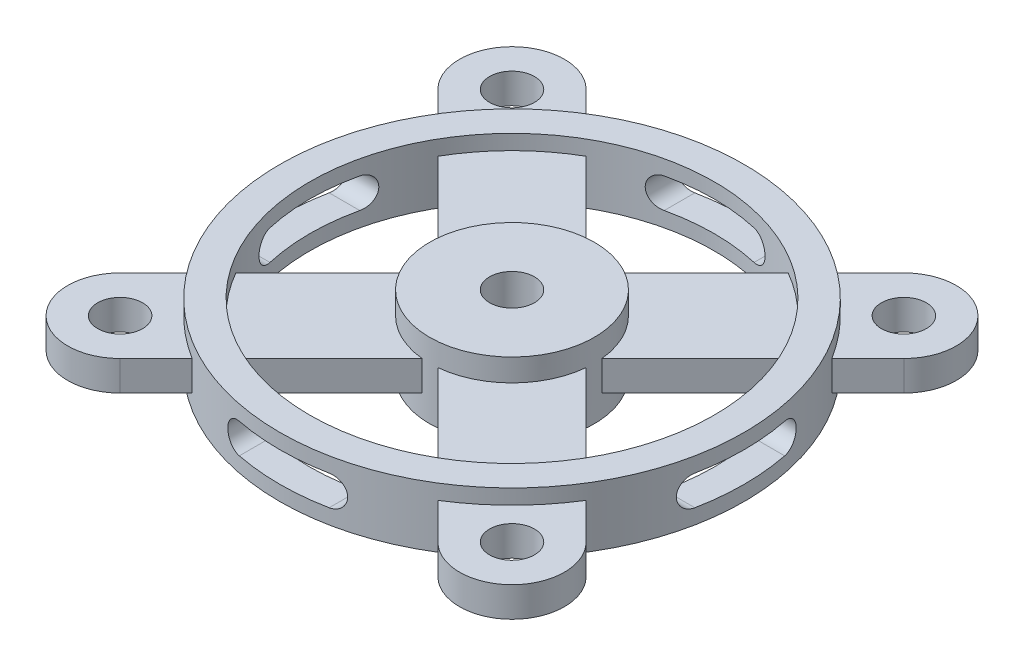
from build123d import *

# Parameters (mm, degrees)
SKETCH1_R                = 15.5
SKETCH1_R_2              = 13.5
BOSS_EXTRUDE1_DEPTH      = 4
CUT_EXTRUDE1_DEPTH       = 44
CUT_EXTRUDE1_DEPTH_BACK  = 44
CUT_EXTRUDE2_DEPTH       = 44
CUT_EXTRUDE2_DEPTH_BACK  = 44
BOSS_EXTRUDE2_DEPTH      = 1
BOSS_EXTRUDE2_DEPTH_BACK = 1
SKETCH5_R                = 1.5
CUT_EXTRUDE3_DEPTH       = 3
BOSS_EXTRUDE3_DEPTH      = 1.5
BOSS_EXTRUDE3_DEPTH_BACK = 3.5
SKETCH6_R                = 5.5
SKETCH6_R_2              = 1.5
SKETCH7_R                = 1.5
CUT_EXTRUDE4_DEPTH       = 11.5


with BuildPart() as part:
    # Sketch1 → Boss-Extrude1 (new body)
    with BuildSketch(Plane(origin=(0, 0, 0), x_dir=(1, 0, 0), z_dir=(0, 1, 0))):
        with Locations(Location((0, 0, 0), (0, 0, 270))):
            Circle(SKETCH1_R)
        with Locations(Location((0, 0, 0), (0, 0, 270))):
            Circle(SKETCH1_R_2, mode=Mode.SUBTRACT)
    extrude(amount=BOSS_EXTRUDE1_DEPTH)

    # Sketch2 → Cut-Extrude1 (cut, two sides: drawn at the far end of the back side and taken through both)
    with BuildSketch(Plane.XY.offset(-CUT_EXTRUDE1_DEPTH_BACK)):
        with BuildLine():
            Line((-3, 3), (3, 3))
            ThreePointArc((3, 3), (4, 2), (3, 1))
            Line((3, 1), (-3, 1))
            ThreePointArc((-3, 1), (-4, 2), (-3, 3))
        make_face()
    extrude(amount=CUT_EXTRUDE1_DEPTH + CUT_EXTRUDE1_DEPTH_BACK, mode=Mode.SUBTRACT)

    # Sketch3 → Cut-Extrude2 (cut, two sides: drawn at the far end of the back side and taken through both)
    with BuildSketch(Plane(origin=(0, 0, 0), x_dir=(0, 0, -1), z_dir=(1, 0, 0)).offset(-CUT_EXTRUDE2_DEPTH_BACK)):
        with BuildLine():
            Line((-3, 3), (3, 3))
            ThreePointArc((3, 3), (4, 2), (3, 1))
            Line((3, 1), (-3, 1))
            ThreePointArc((-3, 1), (-4, 2), (-3, 3))
        make_face()
    extrude(amount=CUT_EXTRUDE2_DEPTH + CUT_EXTRUDE2_DEPTH_BACK, mode=Mode.SUBTRACT)

    # Sketch4 → Boss-Extrude2 (add, two sides: drawn at the far end of the back side and taken through both)
    with BuildSketch(Plane(origin=(0, 2, 0), x_dir=(1, 0, 0), z_dir=(0, 1, 0)).offset(-BOSS_EXTRUDE2_DEPTH_BACK)):
        with BuildLine():
            Line((10.606601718, 15.556349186), (0, 4.949747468))
            Line((0, 4.949747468), (4.949747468, 0))
            Line((4.949747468, 0), (15.556349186, 10.606601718))
            ThreePointArc((15.556349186, 10.606601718), (15.556349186, 15.556349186), (10.606601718, 15.556349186))
        make_face()
        with BuildLine():
            Line((15.556349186, -10.606601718), (4.949747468, 0))
            Line((4.949747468, 0), (0, -4.949747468))
            Line((0, -4.949747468), (10.606601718, -15.556349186))
            ThreePointArc((10.606601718, -15.556349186), (15.556349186, -15.556349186), (15.556349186, -10.606601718))
        make_face()
        with BuildLine():
            Line((0, -4.949747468), (-4.949747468, 0))
            Line((-4.949747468, 0), (-15.556349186, -10.606601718))
            ThreePointArc((-15.556349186, -10.606601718), (-15.556349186, -15.556349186), (-10.606601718, -15.556349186))
            Line((-10.606601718, -15.556349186), (0, -4.949747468))
        make_face()
        Polygon((4.949747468, 0), (0, 4.949747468), (-4.949747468, 0), (0, -4.949747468), align=None)
        with BuildLine():
            Line((0, 4.949747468), (-10.606601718, 15.556349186))
            ThreePointArc((-10.606601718, 15.556349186), (-15.556349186, 15.556349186), (-15.556349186, 10.606601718))
            Line((-15.556349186, 10.606601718), (-4.949747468, 0))
            Line((-4.949747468, 0), (0, 4.949747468))
        make_face()
    extrude(amount=BOSS_EXTRUDE2_DEPTH + BOSS_EXTRUDE2_DEPTH_BACK)

    # Sketch5 → Cut-Extrude3 (cut)
    with BuildSketch(Plane(origin=(0, 3, 0), x_dir=(1, 0, 0), z_dir=(0, 1, 0))):
        with Locations(Location((0, 0, 0), (0, 0, 270))):
            Circle(SKETCH5_R)
    extrude(amount=-CUT_EXTRUDE3_DEPTH, mode=Mode.SUBTRACT)

    # Sketch6 → Boss-Extrude3 (add, two sides: drawn at the far end of the back side and taken through both)
    with BuildSketch(Plane(origin=(0, 3, 0), x_dir=(1, 0, 0), z_dir=(0, 1, 0)).offset(-BOSS_EXTRUDE3_DEPTH_BACK)):
        with Locations(Location((0, 0, 0), (0, 0, 270))):
            Circle(SKETCH6_R)
        with Locations(Location((0, 0, 0), (0, 0, 270))):
            Circle(SKETCH6_R_2, mode=Mode.SUBTRACT)
    extrude(amount=BOSS_EXTRUDE3_DEPTH + BOSS_EXTRUDE3_DEPTH_BACK)

    # Sketch7 → Cut-Extrude4 (cut)
    with BuildSketch(Plane(origin=(0, 3, 0), x_dir=(1, 0, 0), z_dir=(0, 1, 0))):
        with Locations(Location((-13.081475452, 13.081475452, 0), (0, 0, 270))):
            Circle(SKETCH7_R)
        with Locations(Location((13.081475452, 13.081475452, 0), (0, 0, 270))):
            Circle(SKETCH7_R)
        with Locations(Location((13.081475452, -13.081475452, 0), (0, 0, 270))):
            Circle(SKETCH7_R)
        with Locations(Location((-13.081475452, -13.081475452, 0), (0, 0, 270))):
            Circle(SKETCH7_R)
    extrude(amount=-CUT_EXTRUDE4_DEPTH, mode=Mode.SUBTRACT)


solid = part.part
